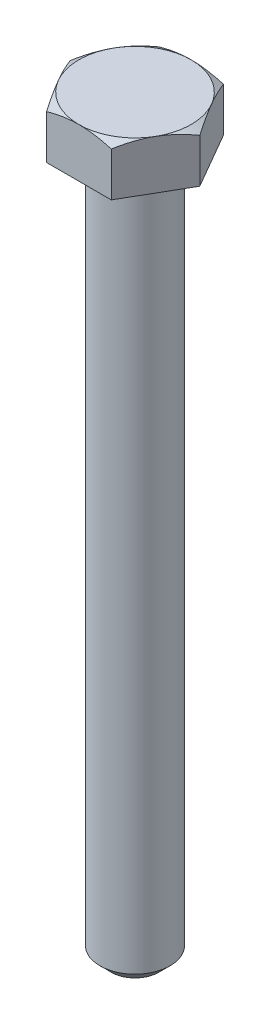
ISO-10303-21;
HEADER;
FILE_DESCRIPTION(('STEP AP214'),'2;1');
FILE_NAME('part.step','',(''),(''),'','','');
FILE_SCHEMA(('AUTOMOTIVE_DESIGN { 1 0 10303 214 1 1 1 1 }'));
ENDSEC;
DATA;
#1=APPLICATION_CONTEXT('core data for automotive mechanical design processes');
#2=APPLICATION_PROTOCOL_DEFINITION('international standard','automotive_design',2000,#1);
#3=PRODUCT_CONTEXT('',#1,'mechanical');
#4=PRODUCT('Part','Part','',(#3));
#5=PRODUCT_RELATED_PRODUCT_CATEGORY('part','',(#4));
#6=PRODUCT_DEFINITION_FORMATION('','',#4);
#7=PRODUCT_DEFINITION_CONTEXT('part definition',#1,'design');
#8=PRODUCT_DEFINITION('design','',#6,#7);
#9=PRODUCT_DEFINITION_SHAPE('','',#8);
#10=(LENGTH_UNIT() NAMED_UNIT(*) SI_UNIT(.MILLI.,.METRE.));
#11=(NAMED_UNIT(*) PLANE_ANGLE_UNIT() SI_UNIT($,.RADIAN.));
#12=(NAMED_UNIT(*) SI_UNIT($,.STERADIAN.) SOLID_ANGLE_UNIT());
#13=UNCERTAINTY_MEASURE_WITH_UNIT(LENGTH_MEASURE(1.E-05),#10,'distance_accuracy_value','');
#14=(GEOMETRIC_REPRESENTATION_CONTEXT(3) GLOBAL_UNCERTAINTY_ASSIGNED_CONTEXT((#13)) GLOBAL_UNIT_ASSIGNED_CONTEXT((#10,
#11,#12)) REPRESENTATION_CONTEXT('',''));
#15=CARTESIAN_POINT('',(0.,0.,0.));
#16=DIRECTION('',(0.,0.,1.));
#17=DIRECTION('',(1.,0.,0.));
#18=AXIS2_PLACEMENT_3D('',#15,#16,#17);
#19=CARTESIAN_POINT('',(0.,3.5,0.));
#20=DIRECTION('',(0.,-1.,0.));
#21=DIRECTION('',(1.,0.,0.));
#22=AXIS2_PLACEMENT_3D('',#19,#20,#21);
#23=PLANE('',#22);
#24=CARTESIAN_POINT('',(0.,3.50000000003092,0.));
#25=DIRECTION('',(0.,-1.,0.));
#26=DIRECTION('',(0.,0.,-1.));
#27=AXIS2_PLACEMENT_3D('',#24,#25,#26);
#28=CIRCLE('',#27,3.99999999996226);
#29=CARTESIAN_POINT('',(3.4641016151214,3.50000000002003,1.99999999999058));
#30=VERTEX_POINT('',#29);
#31=CARTESIAN_POINT('',(0.,3.50000000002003,3.99999999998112));
#32=VERTEX_POINT('',#31);
#33=EDGE_CURVE('E89',#30,#32,#28,.T.);
#34=ORIENTED_EDGE('',*,*,#33,.F.);
#35=CARTESIAN_POINT('',(0.,3.50000000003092,0.));
#36=DIRECTION('',(0.,-1.,0.));
#37=DIRECTION('',(0.,0.,-1.));
#38=AXIS2_PLACEMENT_3D('',#35,#36,#37);
#39=CIRCLE('',#38,3.99999999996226);
#40=CARTESIAN_POINT('',(3.4641016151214,3.50000000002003,-1.99999999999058));
#41=VERTEX_POINT('',#40);
#42=EDGE_CURVE('E87',#41,#30,#39,.T.);
#43=ORIENTED_EDGE('',*,*,#42,.F.);
#44=CARTESIAN_POINT('',(0.,3.50000000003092,0.));
#45=DIRECTION('',(0.,-1.,0.));
#46=DIRECTION('',(0.,0.,-1.));
#47=AXIS2_PLACEMENT_3D('',#44,#45,#46);
#48=CIRCLE('',#47,3.99999999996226);
#49=CARTESIAN_POINT('',(0.,3.50000000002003,-3.99999999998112));
#50=VERTEX_POINT('',#49);
#51=EDGE_CURVE('E20',#50,#41,#48,.T.);
#52=ORIENTED_EDGE('',*,*,#51,.F.);
#53=CARTESIAN_POINT('',(0.,3.50000000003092,0.));
#54=DIRECTION('',(0.,-1.,0.));
#55=DIRECTION('',(0.,0.,-1.));
#56=AXIS2_PLACEMENT_3D('',#53,#54,#55);
#57=CIRCLE('',#56,3.99999999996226);
#58=CARTESIAN_POINT('',(-3.46410161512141,3.50000000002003,-1.99999999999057));
#59=VERTEX_POINT('',#58);
#60=EDGE_CURVE('E104',#59,#50,#57,.T.);
#61=ORIENTED_EDGE('',*,*,#60,.F.);
#62=CARTESIAN_POINT('',(0.,3.50000000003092,0.));
#63=DIRECTION('',(0.,-1.,0.));
#64=DIRECTION('',(0.,0.,-1.));
#65=AXIS2_PLACEMENT_3D('',#62,#63,#64);
#66=CIRCLE('',#65,3.99999999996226);
#67=CARTESIAN_POINT('',(-3.4641016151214,3.50000000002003,1.99999999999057));
#68=VERTEX_POINT('',#67);
#69=EDGE_CURVE('E323',#68,#59,#66,.T.);
#70=ORIENTED_EDGE('',*,*,#69,.F.);
#71=CARTESIAN_POINT('',(0.,3.50000000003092,0.));
#72=DIRECTION('',(0.,-1.,0.));
#73=DIRECTION('',(0.,0.,-1.));
#74=AXIS2_PLACEMENT_3D('',#71,#72,#73);
#75=CIRCLE('',#74,3.99999999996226);
#76=EDGE_CURVE('E93',#32,#68,#75,.T.);
#77=ORIENTED_EDGE('',*,*,#76,.F.);
#78=EDGE_LOOP('',(#34,#43,#52,#61,#70,#77));
#79=FACE_BOUND('',#78,.T.);
#80=ADVANCED_FACE('F16',(#79),#23,.F.);
#81=CARTESIAN_POINT('',(0.,3.14059081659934,0.));
#82=DIRECTION('',(0.,-1.,0.));
#83=DIRECTION('',(0.,0.,-1.));
#84=AXIS2_PLACEMENT_3D('',#81,#82,#83);
#85=CONICAL_SURFACE('',#84,4.62251496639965,1.04719755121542);
#86=ORIENTED_EDGE('',*,*,#51,.T.);
#87=CARTESIAN_POINT('',(2.30940107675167,3.14273441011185,-4.00000000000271));
#88=CARTESIAN_POINT('',(2.4033932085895,3.19701440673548,-3.8372008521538));
#89=CARTESIAN_POINT('',(2.49813806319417,3.24674436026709,-3.67309795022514));
#90=CARTESIAN_POINT('',(2.68846293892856,3.33444223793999,-3.34344559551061));
#91=CARTESIAN_POINT('',(2.78403632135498,3.37246832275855,-3.17790764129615));
#92=CARTESIAN_POINT('',(2.92829837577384,3.41915789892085,-2.92803843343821));
#93=CARTESIAN_POINT('',(2.97656796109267,3.43300183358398,-2.84443305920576));
#94=CARTESIAN_POINT('',(3.07333821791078,3.45696597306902,-2.67682205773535));
#95=CARTESIAN_POINT('',(3.12183888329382,3.46708627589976,-2.59281644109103));
#96=CARTESIAN_POINT('',(3.21925069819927,3.48342533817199,-2.42409422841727));
#97=CARTESIAN_POINT('',(3.26816268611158,3.4896242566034,-2.33937618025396));
#98=CARTESIAN_POINT('',(3.36608285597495,3.49792016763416,-2.16977347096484));
#99=CARTESIAN_POINT('',(3.41509105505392,3.50001634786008,-2.08488878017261));
#100=CARTESIAN_POINT('',(3.46410161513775,3.50000000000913,-2.00000000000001));
#101=B_SPLINE_CURVE_WITH_KNOTS('',3,(#87,#88,#89,#90,#91,#92,#93,#94,#95,#96,#97,#98,#99,#100),
.UNSPECIFIED.,.F.,.F.,(4,2,2,2,2,2,4),(0.,0.587229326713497,1.17149154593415,1.4640059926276,
1.75651273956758,2.05048788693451,2.3445212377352),.UNSPECIFIED.);
#102=CARTESIAN_POINT('',(2.30940107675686,3.14273441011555,-4.00000000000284));
#103=VERTEX_POINT('',#102);
#104=EDGE_CURVE('E99',#103,#41,#101,.T.);
#105=ORIENTED_EDGE('',*,*,#104,.F.);
#106=CARTESIAN_POINT('',(0.,3.50000000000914,-3.99999999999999));
#107=CARTESIAN_POINT('',(0.0980211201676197,3.50001634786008,-3.99999999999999));
#108=CARTESIAN_POINT('',(0.196037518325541,3.49792016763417,-3.99999999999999));
#109=CARTESIAN_POINT('',(0.39187785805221,3.48962425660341,-3.99999999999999));
#110=CARTESIAN_POINT('',(0.489701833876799,3.48342533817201,-3.99999999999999));
#111=CARTESIAN_POINT('',(0.684525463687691,3.46708627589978,-3.99999999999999));
#112=CARTESIAN_POINT('',(0.78152679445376,3.45696597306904,-3.99999999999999));
#113=CARTESIAN_POINT('',(0.975067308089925,3.43300183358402,-3.99999999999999));
#114=CARTESIAN_POINT('',(1.07160647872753,3.41915789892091,-3.99999999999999));
#115=CARTESIAN_POINT('',(1.36013058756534,3.37246832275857,-3.99999999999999));
#116=CARTESIAN_POINT('',(1.55127735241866,3.33444223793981,-3.99999999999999));
#117=CARTESIAN_POINT('',(1.93192710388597,3.24674436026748,-3.99999999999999));
#118=CARTESIAN_POINT('',(2.12141681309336,3.19701440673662,-3.99999999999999));
#119=CARTESIAN_POINT('',(2.30940107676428,3.14273441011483,-3.99999999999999));
#120=B_SPLINE_CURVE_WITH_KNOTS('',3,(#106,#107,#108,#109,#110,#111,#112,#113,#114,#115,#116,
#117,#118,#119),.UNSPECIFIED.,.F.,.F.,(4,2,2,2,2,2,4),(0.,0.294033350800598,0.588008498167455,
0.880515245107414,1.17302969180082,1.75729191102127,2.34452123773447),.UNSPECIFIED.);
#121=EDGE_CURVE('E102',#50,#103,#120,.T.);
#122=ORIENTED_EDGE('',*,*,#121,.F.);
#123=EDGE_LOOP('',(#86,#105,#122));
#124=FACE_BOUND('',#123,.T.);
#125=ADVANCED_FACE('F97',(#124),#85,.T.);
#126=CARTESIAN_POINT('',(0.,3.14059081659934,0.));
#127=DIRECTION('',(0.,-1.,0.));
#128=DIRECTION('',(0.,0.,-1.));
#129=AXIS2_PLACEMENT_3D('',#126,#127,#128);
#130=CONICAL_SURFACE('',#129,4.62251496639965,1.04719755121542);
#131=ORIENTED_EDGE('',*,*,#60,.T.);
#132=CARTESIAN_POINT('',(-2.30940107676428,3.14273441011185,-3.99999999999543));
#133=CARTESIAN_POINT('',(-2.12141681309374,3.19701440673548,-3.9999999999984));
#134=CARTESIAN_POINT('',(-1.93192710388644,3.24674436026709,-3.99999999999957));
#135=CARTESIAN_POINT('',(-1.55127735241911,3.33444223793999,-4.0000000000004));
#136=CARTESIAN_POINT('',(-1.36013058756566,3.37246832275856,-4.00000000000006));
#137=CARTESIAN_POINT('',(-1.07160647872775,3.41915789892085,-3.99999999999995));
#138=CARTESIAN_POINT('',(-0.975067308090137,3.43300183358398,-3.99999999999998));
#139=CARTESIAN_POINT('',(-0.781526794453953,3.45696597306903,-4.));
#140=CARTESIAN_POINT('',(-0.684525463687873,3.46708627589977,-3.99999999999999));
#141=CARTESIAN_POINT('',(-0.489701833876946,3.483425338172,-3.99999999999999));
#142=CARTESIAN_POINT('',(-0.391877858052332,3.4896242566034,-3.99999999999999));
#143=CARTESIAN_POINT('',(-0.196037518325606,3.49792016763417,-3.99999999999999));
#144=CARTESIAN_POINT('',(-0.0980211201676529,3.50001634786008,-3.99999999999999));
#145=CARTESIAN_POINT('',(0.,3.50000000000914,-3.99999999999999));
#146=B_SPLINE_CURVE_WITH_KNOTS('',3,(#132,#133,#134,#135,#136,#137,#138,#139,#140,#141,#142,
#143,#144,#145),.UNSPECIFIED.,.F.,.F.,(4,2,2,2,2,2,4),(0.,0.587229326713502,1.17149154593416,
1.46400599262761,1.7565127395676,2.05048788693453,2.34452123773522),.UNSPECIFIED.);
#147=CARTESIAN_POINT('',(-2.30940107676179,3.14273441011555,-3.99999999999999));
#148=VERTEX_POINT('',#147);
#149=EDGE_CURVE('E113',#148,#50,#146,.T.);
#150=ORIENTED_EDGE('',*,*,#149,.F.);
#151=CARTESIAN_POINT('',(-3.46410161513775,3.50000000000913,-2.00000000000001));
#152=CARTESIAN_POINT('',(-3.41509105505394,3.50001634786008,-2.08488878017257));
#153=CARTESIAN_POINT('',(-3.36608285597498,3.49792016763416,-2.16977347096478));
#154=CARTESIAN_POINT('',(-3.26816268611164,3.4896242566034,-2.33937618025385));
#155=CARTESIAN_POINT('',(-3.21925069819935,3.483425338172,-2.42409422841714));
#156=CARTESIAN_POINT('',(-3.1218388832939,3.46708627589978,-2.59281644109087));
#157=CARTESIAN_POINT('',(-3.07333821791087,3.45696597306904,-2.67682205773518));
#158=CARTESIAN_POINT('',(-2.97656796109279,3.43300183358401,-2.84443305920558));
#159=CARTESIAN_POINT('',(-2.92829837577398,3.41915789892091,-2.92803843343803));
#160=CARTESIAN_POINT('',(-2.78403632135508,3.37246832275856,-3.17790764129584));
#161=CARTESIAN_POINT('',(-2.68846293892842,3.33444223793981,-3.34344559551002));
#162=CARTESIAN_POINT('',(-2.49813806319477,3.24674436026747,-3.67309795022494));
#163=CARTESIAN_POINT('',(-2.40339320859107,3.19701440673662,-3.83720085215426));
#164=CARTESIAN_POINT('',(-2.30940107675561,3.14273441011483,-4.00000000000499));
#165=B_SPLINE_CURVE_WITH_KNOTS('',3,(#151,#152,#153,#154,#155,#156,#157,#158,#159,#160,#161,
#162,#163,#164),.UNSPECIFIED.,.F.,.F.,(4,2,2,2,2,2,4),(0.,0.294033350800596,0.588008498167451,
0.880515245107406,1.17302969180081,1.75729191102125,2.34452123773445),.UNSPECIFIED.);
#166=EDGE_CURVE('E169',#59,#148,#165,.T.);
#167=ORIENTED_EDGE('',*,*,#166,.F.);
#168=EDGE_LOOP('',(#131,#150,#167));
#169=FACE_BOUND('',#168,.T.);
#170=ADVANCED_FACE('F137',(#169),#130,.T.);
#171=CARTESIAN_POINT('',(0.,3.14059081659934,0.));
#172=DIRECTION('',(0.,-1.,0.));
#173=DIRECTION('',(0.,0.,-1.));
#174=AXIS2_PLACEMENT_3D('',#171,#172,#173);
#175=CONICAL_SURFACE('',#174,4.62251496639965,1.04719755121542);
#176=ORIENTED_EDGE('',*,*,#69,.T.);
#177=CARTESIAN_POINT('',(-4.61880215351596,3.14273441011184,7.28269114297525E-12));
#178=CARTESIAN_POINT('',(-4.52481002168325,3.19701440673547,-0.162799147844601));
#179=CARTESIAN_POINT('',(-4.43006516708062,3.24674436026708,-0.326902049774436));
#180=CARTESIAN_POINT('',(-4.23974029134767,3.33444223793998,-0.656554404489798));
#181=CARTESIAN_POINT('',(-4.14416690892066,3.37246832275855,-0.822092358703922));
#182=CARTESIAN_POINT('',(-3.9999048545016,3.41915789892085,-1.07196156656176));
#183=CARTESIAN_POINT('',(-3.95163526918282,3.43300183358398,-1.15556694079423));
#184=CARTESIAN_POINT('',(-3.85486501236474,3.45696597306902,-1.32317794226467));
#185=CARTESIAN_POINT('',(-3.80636434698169,3.46708627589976,-1.40718355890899));
#186=CARTESIAN_POINT('',(-3.70895253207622,3.48342533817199,-1.57590577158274));
#187=CARTESIAN_POINT('',(-3.66004054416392,3.4896242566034,-1.66062381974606));
#188=CARTESIAN_POINT('',(-3.56212037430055,3.49792016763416,-1.83022652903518));
#189=CARTESIAN_POINT('',(-3.51311217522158,3.50001634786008,-1.91511121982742));
#190=CARTESIAN_POINT('',(-3.46410161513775,3.50000000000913,-2.00000000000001));
#191=B_SPLINE_CURVE_WITH_KNOTS('',3,(#177,#178,#179,#180,#181,#182,#183,#184,#185,#186,#187,
#188,#189,#190),.UNSPECIFIED.,.F.,.F.,(4,2,2,2,2,2,4),(0.,0.587229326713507,1.17149154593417,
1.46400599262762,1.75651273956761,2.05048788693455,2.34452123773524),.UNSPECIFIED.);
#192=CARTESIAN_POINT('',(-4.61880215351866,3.14273441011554,2.84568771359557E-12));
#193=VERTEX_POINT('',#192);
#194=EDGE_CURVE('E146',#193,#59,#191,.T.);
#195=ORIENTED_EDGE('',*,*,#194,.F.);
#196=CARTESIAN_POINT('',(-3.46410161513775,3.50000000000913,2.00000000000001));
#197=CARTESIAN_POINT('',(-3.51311217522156,3.50001634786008,1.91511121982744));
#198=CARTESIAN_POINT('',(-3.56212037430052,3.49792016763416,1.83022652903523));
#199=CARTESIAN_POINT('',(-3.66004054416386,3.4896242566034,1.66062381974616));
#200=CARTESIAN_POINT('',(-3.70895253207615,3.483425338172,1.57590577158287));
#201=CARTESIAN_POINT('',(-3.8063643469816,3.46708627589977,1.40718355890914));
#202=CARTESIAN_POINT('',(-3.85486501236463,3.45696597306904,1.32317794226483));
#203=CARTESIAN_POINT('',(-3.95163526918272,3.43300183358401,1.15556694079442));
#204=CARTESIAN_POINT('',(-3.99990485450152,3.4191578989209,1.07196156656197));
#205=CARTESIAN_POINT('',(-4.14416690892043,3.37246832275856,0.822092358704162));
#206=CARTESIAN_POINT('',(-4.23974029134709,3.3344422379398,0.656554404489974));
#207=CARTESIAN_POINT('',(-4.43006516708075,3.24674436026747,0.326902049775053));
#208=CARTESIAN_POINT('',(-4.52481002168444,3.19701440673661,0.162799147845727));
#209=CARTESIAN_POINT('',(-4.6188021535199,3.14273441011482,-5.00296073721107E-12));
#210=B_SPLINE_CURVE_WITH_KNOTS('',3,(#196,#197,#198,#199,#200,#201,#202,#203,#204,#205,#206,
#207,#208,#209),.UNSPECIFIED.,.F.,.F.,(4,2,2,2,2,2,4),(0.,0.294033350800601,0.58800849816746,
0.880515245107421,1.17302969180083,1.75729191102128,2.34452123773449),.UNSPECIFIED.);
#211=EDGE_CURVE('E183',#68,#193,#210,.T.);
#212=ORIENTED_EDGE('',*,*,#211,.F.);
#213=EDGE_LOOP('',(#176,#195,#212));
#214=FACE_BOUND('',#213,.T.);
#215=ADVANCED_FACE('F191',(#214),#175,.T.);
#216=CARTESIAN_POINT('',(0.,3.14059081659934,0.));
#217=DIRECTION('',(0.,-1.,0.));
#218=DIRECTION('',(0.,0.,-1.));
#219=AXIS2_PLACEMENT_3D('',#216,#217,#218);
#220=CONICAL_SURFACE('',#219,4.62251496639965,1.04719755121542);
#221=ORIENTED_EDGE('',*,*,#76,.T.);
#222=CARTESIAN_POINT('',(-2.30940107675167,3.14273441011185,4.00000000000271));
#223=CARTESIAN_POINT('',(-2.4033932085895,3.19701440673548,3.8372008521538));
#224=CARTESIAN_POINT('',(-2.49813806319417,3.24674436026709,3.67309795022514));
#225=CARTESIAN_POINT('',(-2.68846293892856,3.33444223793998,3.34344559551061));
#226=CARTESIAN_POINT('',(-2.78403632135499,3.37246832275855,3.17790764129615));
#227=CARTESIAN_POINT('',(-2.92829837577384,3.41915789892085,2.92803843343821));
#228=CARTESIAN_POINT('',(-2.97656796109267,3.43300183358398,2.84443305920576));
#229=CARTESIAN_POINT('',(-3.07333821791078,3.45696597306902,2.67682205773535));
#230=CARTESIAN_POINT('',(-3.12183888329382,3.46708627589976,2.59281644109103));
#231=CARTESIAN_POINT('',(-3.21925069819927,3.48342533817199,2.42409422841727));
#232=CARTESIAN_POINT('',(-3.26816268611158,3.4896242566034,2.33937618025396));
#233=CARTESIAN_POINT('',(-3.36608285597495,3.49792016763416,2.16977347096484));
#234=CARTESIAN_POINT('',(-3.41509105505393,3.50001634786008,2.08488878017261));
#235=CARTESIAN_POINT('',(-3.46410161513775,3.50000000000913,2.00000000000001));
#236=B_SPLINE_CURVE_WITH_KNOTS('',3,(#222,#223,#224,#225,#226,#227,#228,#229,#230,#231,#232,
#233,#234,#235),.UNSPECIFIED.,.F.,.F.,(4,2,2,2,2,2,4),(0.,0.587229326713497,1.17149154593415,
1.4640059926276,1.75651273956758,2.05048788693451,2.3445212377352),.UNSPECIFIED.);
#237=CARTESIAN_POINT('',(-2.30940107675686,3.14273441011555,4.00000000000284));
#238=VERTEX_POINT('',#237);
#239=EDGE_CURVE('E176',#238,#68,#236,.T.);
#240=ORIENTED_EDGE('',*,*,#239,.F.);
#241=CARTESIAN_POINT('',(0.,3.50000000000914,3.99999999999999));
#242=CARTESIAN_POINT('',(-0.0980211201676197,3.50001634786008,3.99999999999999));
#243=CARTESIAN_POINT('',(-0.196037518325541,3.49792016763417,3.99999999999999));
#244=CARTESIAN_POINT('',(-0.391877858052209,3.48962425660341,3.99999999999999));
#245=CARTESIAN_POINT('',(-0.489701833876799,3.48342533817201,3.99999999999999));
#246=CARTESIAN_POINT('',(-0.684525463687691,3.46708627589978,3.99999999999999));
#247=CARTESIAN_POINT('',(-0.78152679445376,3.45696597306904,3.99999999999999));
#248=CARTESIAN_POINT('',(-0.975067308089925,3.43300183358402,3.99999999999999));
#249=CARTESIAN_POINT('',(-1.07160647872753,3.41915789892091,3.99999999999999));
#250=CARTESIAN_POINT('',(-1.36013058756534,3.37246832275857,3.99999999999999));
#251=CARTESIAN_POINT('',(-1.55127735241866,3.33444223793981,3.99999999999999));
#252=CARTESIAN_POINT('',(-1.93192710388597,3.24674436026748,3.99999999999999));
#253=CARTESIAN_POINT('',(-2.12141681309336,3.19701440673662,3.99999999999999));
#254=CARTESIAN_POINT('',(-2.30940107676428,3.14273441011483,3.99999999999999));
#255=B_SPLINE_CURVE_WITH_KNOTS('',3,(#241,#242,#243,#244,#245,#246,#247,#248,#249,#250,#251,
#252,#253,#254),.UNSPECIFIED.,.F.,.F.,(4,2,2,2,2,2,4),(0.,0.294033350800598,0.588008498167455,
0.880515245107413,1.17302969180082,1.75729191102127,2.34452123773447),.UNSPECIFIED.);
#256=EDGE_CURVE('E198',#32,#238,#255,.T.);
#257=ORIENTED_EDGE('',*,*,#256,.F.);
#258=EDGE_LOOP('',(#221,#240,#257));
#259=FACE_BOUND('',#258,.T.);
#260=ADVANCED_FACE('F188',(#259),#220,.T.);
#261=CARTESIAN_POINT('',(0.,3.14059081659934,0.));
#262=DIRECTION('',(0.,-1.,0.));
#263=DIRECTION('',(0.,0.,-1.));
#264=AXIS2_PLACEMENT_3D('',#261,#262,#263);
#265=CONICAL_SURFACE('',#264,4.62251496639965,1.04719755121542);
#266=ORIENTED_EDGE('',*,*,#42,.T.);
#267=CARTESIAN_POINT('',(4.61880215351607,3.1427344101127,-5.88236889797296E-12));
#268=CARTESIAN_POINT('',(4.52481002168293,3.19701440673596,0.16279914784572));
#269=CARTESIAN_POINT('',(4.43006516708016,3.24674436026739,0.326902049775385));
#270=CARTESIAN_POINT('',(4.23974029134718,3.33444223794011,0.656554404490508));
#271=CARTESIAN_POINT('',(4.14416690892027,3.37246832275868,0.822092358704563));
#272=CARTESIAN_POINT('',(3.99990485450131,3.41915789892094,1.07196156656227));
#273=CARTESIAN_POINT('',(3.95163526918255,3.43300183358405,1.1555669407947));
#274=CARTESIAN_POINT('',(3.85486501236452,3.45696597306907,1.32317794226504));
#275=CARTESIAN_POINT('',(3.8063643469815,3.4670862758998,1.40718355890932));
#276=CARTESIAN_POINT('',(3.70895253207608,3.48342533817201,1.57590577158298));
#277=CARTESIAN_POINT('',(3.6600405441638,3.48962425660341,1.66062381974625));
#278=CARTESIAN_POINT('',(3.5621203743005,3.49792016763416,1.83022652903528));
#279=CARTESIAN_POINT('',(3.51311217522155,3.50001634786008,1.91511121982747));
#280=CARTESIAN_POINT('',(3.46410161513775,3.50000000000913,2.00000000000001));
#281=B_SPLINE_CURVE_WITH_KNOTS('',3,(#267,#268,#269,#270,#271,#272,#273,#274,#275,#276,#277,
#278,#279,#280),.UNSPECIFIED.,.F.,.F.,(4,2,2,2,2,2,4),(0.,0.587229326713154,1.17149154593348,
1.46400599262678,1.75651273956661,2.05048788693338,2.34452123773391),.UNSPECIFIED.);
#282=CARTESIAN_POINT('',(4.61880215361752,3.14273441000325,2.28554564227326E-12));
#283=VERTEX_POINT('',#282);
#284=EDGE_CURVE('E109',#283,#30,#281,.T.);
#285=ORIENTED_EDGE('',*,*,#284,.F.);
#286=CARTESIAN_POINT('',(3.46410161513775,3.50000000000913,-2.00000000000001));
#287=CARTESIAN_POINT('',(3.51311217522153,3.50001634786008,-1.91511121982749));
#288=CARTESIAN_POINT('',(3.56212037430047,3.49792016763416,-1.83022652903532));
#289=CARTESIAN_POINT('',(3.66004054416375,3.48962425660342,-1.66062381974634));
#290=CARTESIAN_POINT('',(3.70895253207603,3.48342533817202,-1.57590577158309));
#291=CARTESIAN_POINT('',(3.80636434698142,3.46708627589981,-1.40718355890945));
#292=CARTESIAN_POINT('',(3.85486501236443,3.45696597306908,-1.32317794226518));
#293=CARTESIAN_POINT('',(3.95163526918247,3.43300183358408,-1.15556694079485));
#294=CARTESIAN_POINT('',(3.99990485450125,3.41915789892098,-1.07196156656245));
#295=CARTESIAN_POINT('',(4.14416690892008,3.37246832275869,-0.82209235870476));
#296=CARTESIAN_POINT('',(4.2397402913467,3.33444223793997,-0.656554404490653));
#297=CARTESIAN_POINT('',(4.43006516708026,3.24674436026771,-0.326902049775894));
#298=CARTESIAN_POINT('',(4.52481002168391,3.1970144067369,-0.162799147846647));
#299=CARTESIAN_POINT('',(4.61880215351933,3.14273441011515,4.0037334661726E-12));
#300=B_SPLINE_CURVE_WITH_KNOTS('',3,(#286,#287,#288,#289,#290,#291,#292,#293,#294,#295,#296,
#297,#298,#299),.UNSPECIFIED.,.F.,.F.,(4,2,2,2,2,2,4),(0.,0.294033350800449,0.588008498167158,
0.880515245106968,1.17302969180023,1.75729191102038,2.34452123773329),.UNSPECIFIED.);
#301=EDGE_CURVE('E106',#41,#283,#300,.T.);
#302=ORIENTED_EDGE('',*,*,#301,.F.);
#303=EDGE_LOOP('',(#266,#285,#302));
#304=FACE_BOUND('',#303,.T.);
#305=ADVANCED_FACE('F107',(#304),#265,.T.);
#306=CARTESIAN_POINT('',(0.,3.14059081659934,0.));
#307=DIRECTION('',(0.,-1.,0.));
#308=DIRECTION('',(0.,0.,-1.));
#309=AXIS2_PLACEMENT_3D('',#306,#307,#308);
#310=CONICAL_SURFACE('',#309,4.62251496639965,1.04719755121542);
#311=ORIENTED_EDGE('',*,*,#33,.T.);
#312=CARTESIAN_POINT('',(2.30940107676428,3.14273441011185,3.99999999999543));
#313=CARTESIAN_POINT('',(2.12141681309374,3.19701440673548,3.9999999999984));
#314=CARTESIAN_POINT('',(1.93192710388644,3.24674436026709,3.99999999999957));
#315=CARTESIAN_POINT('',(1.55127735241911,3.33444223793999,4.0000000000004));
#316=CARTESIAN_POINT('',(1.36013058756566,3.37246832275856,4.00000000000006));
#317=CARTESIAN_POINT('',(1.07160647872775,3.41915789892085,3.99999999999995));
#318=CARTESIAN_POINT('',(0.975067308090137,3.43300183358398,3.99999999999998));
#319=CARTESIAN_POINT('',(0.781526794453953,3.45696597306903,4.));
#320=CARTESIAN_POINT('',(0.684525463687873,3.46708627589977,3.99999999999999));
#321=CARTESIAN_POINT('',(0.489701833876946,3.483425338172,3.99999999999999));
#322=CARTESIAN_POINT('',(0.391877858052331,3.4896242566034,3.99999999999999));
#323=CARTESIAN_POINT('',(0.196037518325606,3.49792016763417,3.99999999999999));
#324=CARTESIAN_POINT('',(0.0980211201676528,3.50001634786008,3.99999999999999));
#325=CARTESIAN_POINT('',(0.,3.50000000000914,3.99999999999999));
#326=B_SPLINE_CURVE_WITH_KNOTS('',3,(#312,#313,#314,#315,#316,#317,#318,#319,#320,#321,#322,
#323,#324,#325),.UNSPECIFIED.,.F.,.F.,(4,2,2,2,2,2,4),(0.,0.587229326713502,1.17149154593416,
1.46400599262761,1.7565127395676,2.05048788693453,2.34452123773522),.UNSPECIFIED.);
#327=CARTESIAN_POINT('',(2.30940107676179,3.14273441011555,3.99999999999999));
#328=VERTEX_POINT('',#327);
#329=EDGE_CURVE('E205',#328,#32,#326,.T.);
#330=ORIENTED_EDGE('',*,*,#329,.F.);
#331=CARTESIAN_POINT('',(3.46410161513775,3.50000000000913,2.00000000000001));
#332=CARTESIAN_POINT('',(3.41509105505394,3.50001634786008,2.08488878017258));
#333=CARTESIAN_POINT('',(3.36608285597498,3.49792016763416,2.16977347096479));
#334=CARTESIAN_POINT('',(3.26816268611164,3.4896242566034,2.33937618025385));
#335=CARTESIAN_POINT('',(3.21925069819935,3.483425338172,2.42409422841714));
#336=CARTESIAN_POINT('',(3.1218388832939,3.46708627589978,2.59281644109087));
#337=CARTESIAN_POINT('',(3.07333821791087,3.45696597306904,2.67682205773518));
#338=CARTESIAN_POINT('',(2.97656796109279,3.43300183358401,2.84443305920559));
#339=CARTESIAN_POINT('',(2.92829837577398,3.41915789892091,2.92803843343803));
#340=CARTESIAN_POINT('',(2.78403632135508,3.37246832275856,3.17790764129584));
#341=CARTESIAN_POINT('',(2.68846293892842,3.33444223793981,3.34344559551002));
#342=CARTESIAN_POINT('',(2.49813806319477,3.24674436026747,3.67309795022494));
#343=CARTESIAN_POINT('',(2.40339320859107,3.19701440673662,3.83720085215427));
#344=CARTESIAN_POINT('',(2.30940107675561,3.14273441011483,4.00000000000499));
#345=B_SPLINE_CURVE_WITH_KNOTS('',3,(#331,#332,#333,#334,#335,#336,#337,#338,#339,#340,#341,
#342,#343,#344),.UNSPECIFIED.,.F.,.F.,(4,2,2,2,2,2,4),(0.,0.294033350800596,0.588008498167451,
0.880515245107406,1.17302969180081,1.75729191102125,2.34452123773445),.UNSPECIFIED.);
#346=EDGE_CURVE('E225',#30,#328,#345,.T.);
#347=ORIENTED_EDGE('',*,*,#346,.F.);
#348=EDGE_LOOP('',(#311,#330,#347));
#349=FACE_BOUND('',#348,.T.);
#350=ADVANCED_FACE('F233',(#349),#310,.T.);
#351=CARTESIAN_POINT('',(0.,-50.,0.));
#352=DIRECTION('',(0.,1.,0.));
#353=DIRECTION('',(0.,0.,1.));
#354=AXIS2_PLACEMENT_3D('',#351,#352,#353);
#355=PLANE('',#354);
#356=CARTESIAN_POINT('',(0.,-50.0000000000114,0.));
#357=DIRECTION('',(0.,1.,0.));
#358=DIRECTION('',(-1.,0.,0.));
#359=AXIS2_PLACEMENT_3D('',#356,#357,#358);
#360=CIRCLE('',#359,1.69999999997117);
#361=CARTESIAN_POINT('',(-1.69999999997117,-50.0000000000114,0.));
#362=VERTEX_POINT('',#361);
#363=EDGE_CURVE('E232',#362,#362,#360,.T.);
#364=ORIENTED_EDGE('',*,*,#363,.F.);
#365=EDGE_LOOP('',(#364));
#366=FACE_BOUND('',#365,.T.);
#367=ADVANCED_FACE('F236',(#366),#355,.F.);
#368=CARTESIAN_POINT('',(2.3094010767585,19.66,-3.99999999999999));
#369=DIRECTION('',(0.866025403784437,0.,-0.500000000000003));
#370=DIRECTION('',(-0.500000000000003,0.,-0.866025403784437));
#371=AXIS2_PLACEMENT_3D('',#368,#369,#370);
#372=PLANE('',#371);
#373=DIRECTION('',(-0.500000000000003,0.,-0.866025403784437));
#374=VECTOR('',#373,1.);
#375=CARTESIAN_POINT('',(4.61880215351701,0.,0.));
#376=LINE('',#375,#374);
#377=CARTESIAN_POINT('',(4.61880215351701,0.,0.));
#378=VERTEX_POINT('',#377);
#379=CARTESIAN_POINT('',(2.3094010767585,0.,-3.99999999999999));
#380=VERTEX_POINT('',#379);
#381=EDGE_CURVE('E269',#378,#380,#376,.T.);
#382=ORIENTED_EDGE('',*,*,#381,.T.);
#383=DIRECTION('',(0.,1.,0.));
#384=VECTOR('',#383,1.);
#385=CARTESIAN_POINT('',(2.3094010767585,19.66,-3.99999999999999));
#386=LINE('',#385,#384);
#387=EDGE_CURVE('E117',#103,#380,#386,.F.);
#388=ORIENTED_EDGE('',*,*,#387,.F.);
#389=ORIENTED_EDGE('',*,*,#104,.T.);
#390=ORIENTED_EDGE('',*,*,#301,.T.);
#391=DIRECTION('',(0.,1.,0.));
#392=VECTOR('',#391,1.);
#393=CARTESIAN_POINT('',(4.61880215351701,19.66,0.));
#394=LINE('',#393,#392);
#395=EDGE_CURVE('E312',#378,#283,#394,.T.);
#396=ORIENTED_EDGE('',*,*,#395,.F.);
#397=EDGE_LOOP('',(#382,#388,#389,#390,#396));
#398=FACE_BOUND('',#397,.T.);
#399=ADVANCED_FACE('F115',(#398),#372,.T.);
#400=CARTESIAN_POINT('',(-2.3094010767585,19.66,-3.99999999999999));
#401=DIRECTION('',(0.,0.,-1.));
#402=DIRECTION('',(-1.,0.,0.));
#403=AXIS2_PLACEMENT_3D('',#400,#401,#402);
#404=PLANE('',#403);
#405=DIRECTION('',(-1.,0.,0.));
#406=VECTOR('',#405,1.);
#407=CARTESIAN_POINT('',(0.,0.,-3.99999999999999));
#408=LINE('',#407,#406);
#409=CARTESIAN_POINT('',(-2.3094010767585,0.,-3.99999999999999));
#410=VERTEX_POINT('',#409);
#411=EDGE_CURVE('E271',#380,#410,#408,.T.);
#412=ORIENTED_EDGE('',*,*,#411,.T.);
#413=DIRECTION('',(0.,1.,0.));
#414=VECTOR('',#413,1.);
#415=CARTESIAN_POINT('',(-2.3094010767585,19.66,-3.99999999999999));
#416=LINE('',#415,#414);
#417=EDGE_CURVE('E175',#148,#410,#416,.F.);
#418=ORIENTED_EDGE('',*,*,#417,.F.);
#419=ORIENTED_EDGE('',*,*,#149,.T.);
#420=ORIENTED_EDGE('',*,*,#121,.T.);
#421=ORIENTED_EDGE('',*,*,#387,.T.);
#422=EDGE_LOOP('',(#412,#418,#419,#420,#421));
#423=FACE_BOUND('',#422,.T.);
#424=ADVANCED_FACE('F155',(#423),#404,.T.);
#425=CARTESIAN_POINT('',(-2.3094010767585,19.66,-3.99999999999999));
#426=DIRECTION('',(-0.866025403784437,0.,-0.500000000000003));
#427=DIRECTION('',(-0.500000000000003,0.,0.866025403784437));
#428=AXIS2_PLACEMENT_3D('',#425,#426,#427);
#429=PLANE('',#428);
#430=DIRECTION('',(-0.500000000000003,0.,0.866025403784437));
#431=VECTOR('',#430,1.);
#432=CARTESIAN_POINT('',(-2.3094010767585,0.,-3.99999999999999));
#433=LINE('',#432,#431);
#434=CARTESIAN_POINT('',(-4.61880215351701,0.,0.));
#435=VERTEX_POINT('',#434);
#436=EDGE_CURVE('E279',#410,#435,#433,.T.);
#437=ORIENTED_EDGE('',*,*,#436,.T.);
#438=DIRECTION('',(0.,1.,0.));
#439=VECTOR('',#438,1.);
#440=CARTESIAN_POINT('',(-4.61880215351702,19.66,0.));
#441=LINE('',#440,#439);
#442=EDGE_CURVE('E302',#193,#435,#441,.F.);
#443=ORIENTED_EDGE('',*,*,#442,.F.);
#444=ORIENTED_EDGE('',*,*,#194,.T.);
#445=ORIENTED_EDGE('',*,*,#166,.T.);
#446=ORIENTED_EDGE('',*,*,#417,.T.);
#447=EDGE_LOOP('',(#437,#443,#444,#445,#446));
#448=FACE_BOUND('',#447,.T.);
#449=ADVANCED_FACE('F158',(#448),#429,.T.);
#450=CARTESIAN_POINT('',(-2.3094010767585,19.66,3.99999999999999));
#451=DIRECTION('',(-0.866025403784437,0.,0.500000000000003));
#452=DIRECTION('',(0.500000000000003,0.,0.866025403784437));
#453=AXIS2_PLACEMENT_3D('',#450,#451,#452);
#454=PLANE('',#453);
#455=DIRECTION('',(0.500000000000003,0.,0.866025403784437));
#456=VECTOR('',#455,1.);
#457=CARTESIAN_POINT('',(-4.61880215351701,0.,0.));
#458=LINE('',#457,#456);
#459=CARTESIAN_POINT('',(-2.3094010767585,0.,3.99999999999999));
#460=VERTEX_POINT('',#459);
#461=EDGE_CURVE('E275',#435,#460,#458,.T.);
#462=ORIENTED_EDGE('',*,*,#461,.T.);
#463=DIRECTION('',(0.,1.,0.));
#464=VECTOR('',#463,1.);
#465=CARTESIAN_POINT('',(-2.3094010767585,19.66,3.99999999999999));
#466=LINE('',#465,#464);
#467=EDGE_CURVE('E204',#238,#460,#466,.F.);
#468=ORIENTED_EDGE('',*,*,#467,.F.);
#469=ORIENTED_EDGE('',*,*,#239,.T.);
#470=ORIENTED_EDGE('',*,*,#211,.T.);
#471=ORIENTED_EDGE('',*,*,#442,.T.);
#472=EDGE_LOOP('',(#462,#468,#469,#470,#471));
#473=FACE_BOUND('',#472,.T.);
#474=ADVANCED_FACE('F164',(#473),#454,.T.);
#475=CARTESIAN_POINT('',(-2.3094010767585,19.66,3.99999999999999));
#476=DIRECTION('',(0.,0.,1.));
#477=DIRECTION('',(1.,0.,0.));
#478=AXIS2_PLACEMENT_3D('',#475,#476,#477);
#479=PLANE('',#478);
#480=DIRECTION('',(-1.,0.,0.));
#481=VECTOR('',#480,1.);
#482=CARTESIAN_POINT('',(0.,0.,3.99999999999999));
#483=LINE('',#482,#481);
#484=CARTESIAN_POINT('',(2.3094010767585,0.,3.99999999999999));
#485=VERTEX_POINT('',#484);
#486=EDGE_CURVE('E35',#460,#485,#483,.F.);
#487=ORIENTED_EDGE('',*,*,#486,.T.);
#488=DIRECTION('',(0.,1.,0.));
#489=VECTOR('',#488,1.);
#490=CARTESIAN_POINT('',(2.3094010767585,19.66,3.99999999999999));
#491=LINE('',#490,#489);
#492=EDGE_CURVE('E231',#328,#485,#491,.F.);
#493=ORIENTED_EDGE('',*,*,#492,.F.);
#494=ORIENTED_EDGE('',*,*,#329,.T.);
#495=ORIENTED_EDGE('',*,*,#256,.T.);
#496=ORIENTED_EDGE('',*,*,#467,.T.);
#497=EDGE_LOOP('',(#487,#493,#494,#495,#496));
#498=FACE_BOUND('',#497,.T.);
#499=ADVANCED_FACE('F214',(#498),#479,.T.);
#500=CARTESIAN_POINT('',(2.3094010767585,19.66,3.99999999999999));
#501=DIRECTION('',(0.866025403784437,0.,0.500000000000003));
#502=DIRECTION('',(0.500000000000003,0.,-0.866025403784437));
#503=AXIS2_PLACEMENT_3D('',#500,#501,#502);
#504=PLANE('',#503);
#505=DIRECTION('',(0.500000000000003,0.,-0.866025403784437));
#506=VECTOR('',#505,1.);
#507=CARTESIAN_POINT('',(2.3094010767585,0.,3.99999999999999));
#508=LINE('',#507,#506);
#509=EDGE_CURVE('E259',#485,#378,#508,.T.);
#510=ORIENTED_EDGE('',*,*,#509,.T.);
#511=ORIENTED_EDGE('',*,*,#395,.T.);
#512=ORIENTED_EDGE('',*,*,#284,.T.);
#513=ORIENTED_EDGE('',*,*,#346,.T.);
#514=ORIENTED_EDGE('',*,*,#492,.T.);
#515=EDGE_LOOP('',(#510,#511,#512,#513,#514));
#516=FACE_BOUND('',#515,.T.);
#517=ADVANCED_FACE('F217',(#516),#504,.T.);
#518=CARTESIAN_POINT('',(0.,-49.2000000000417,0.));
#519=DIRECTION('',(0.,1.,0.));
#520=DIRECTION('',(-1.,0.,0.));
#521=AXIS2_PLACEMENT_3D('',#518,#519,#520);
#522=CONICAL_SURFACE('',#521,2.49999999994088,0.785398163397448);
#523=ORIENTED_EDGE('',*,*,#363,.T.);
#524=EDGE_LOOP('',(#523));
#525=FACE_BOUND('',#524,.T.);
#526=CARTESIAN_POINT('',(0.,-49.2,0.));
#527=DIRECTION('',(0.,1.,0.));
#528=DIRECTION('',(0.,0.,1.));
#529=AXIS2_PLACEMENT_3D('',#526,#527,#528);
#530=CIRCLE('',#529,2.5);
#531=CARTESIAN_POINT('',(0.,-49.2,2.5));
#532=VERTEX_POINT('',#531);
#533=EDGE_CURVE('E26',#532,#532,#530,.T.);
#534=ORIENTED_EDGE('',*,*,#533,.F.);
#535=EDGE_LOOP('',(#534));
#536=FACE_BOUND('',#535,.T.);
#537=ADVANCED_FACE('F222',(#525,#536),#522,.T.);
#538=CARTESIAN_POINT('',(0.,0.,0.));
#539=DIRECTION('',(0.,1.,0.));
#540=DIRECTION('',(-1.,0.,0.));
#541=AXIS2_PLACEMENT_3D('',#538,#539,#540);
#542=PLANE('',#541);
#543=ORIENTED_EDGE('',*,*,#486,.F.);
#544=ORIENTED_EDGE('',*,*,#461,.F.);
#545=ORIENTED_EDGE('',*,*,#436,.F.);
#546=ORIENTED_EDGE('',*,*,#411,.F.);
#547=ORIENTED_EDGE('',*,*,#381,.F.);
#548=ORIENTED_EDGE('',*,*,#509,.F.);
#549=EDGE_LOOP('',(#543,#544,#545,#546,#547,#548));
#550=FACE_BOUND('',#549,.T.);
#551=CARTESIAN_POINT('',(0.,0.,0.));
#552=DIRECTION('',(0.,1.,0.));
#553=DIRECTION('',(0.,0.,1.));
#554=AXIS2_PLACEMENT_3D('',#551,#552,#553);
#555=CIRCLE('',#554,2.5);
#556=CARTESIAN_POINT('',(0.,0.,2.5));
#557=VERTEX_POINT('',#556);
#558=EDGE_CURVE('E10',#557,#557,#555,.F.);
#559=ORIENTED_EDGE('',*,*,#558,.F.);
#560=EDGE_LOOP('',(#559));
#561=FACE_BOUND('',#560,.T.);
#562=ADVANCED_FACE('F247',(#550,#561),#542,.F.);
#563=CARTESIAN_POINT('',(0.,-50.,0.));
#564=DIRECTION('',(0.,1.,0.));
#565=DIRECTION('',(0.,0.,1.));
#566=AXIS2_PLACEMENT_3D('',#563,#564,#565);
#567=CYLINDRICAL_SURFACE('',#566,2.5);
#568=ORIENTED_EDGE('',*,*,#533,.T.);
#569=EDGE_LOOP('',(#568));
#570=FACE_BOUND('',#569,.T.);
#571=ORIENTED_EDGE('',*,*,#558,.T.);
#572=EDGE_LOOP('',(#571));
#573=FACE_BOUND('',#572,.T.);
#574=ADVANCED_FACE('F18',(#570,#573),#567,.T.);
#575=CLOSED_SHELL('',(#80,#125,#170,#215,#260,#305,#350,#367,#399,#424,#449,#474,#499,#517,#537,
#562,#574));
#576=MANIFOLD_SOLID_BREP('B1',#575);
#577=ADVANCED_BREP_SHAPE_REPRESENTATION('',(#18,#576),#14);
#578=SHAPE_DEFINITION_REPRESENTATION(#9,#577);
ENDSEC;
END-ISO-10303-21;
